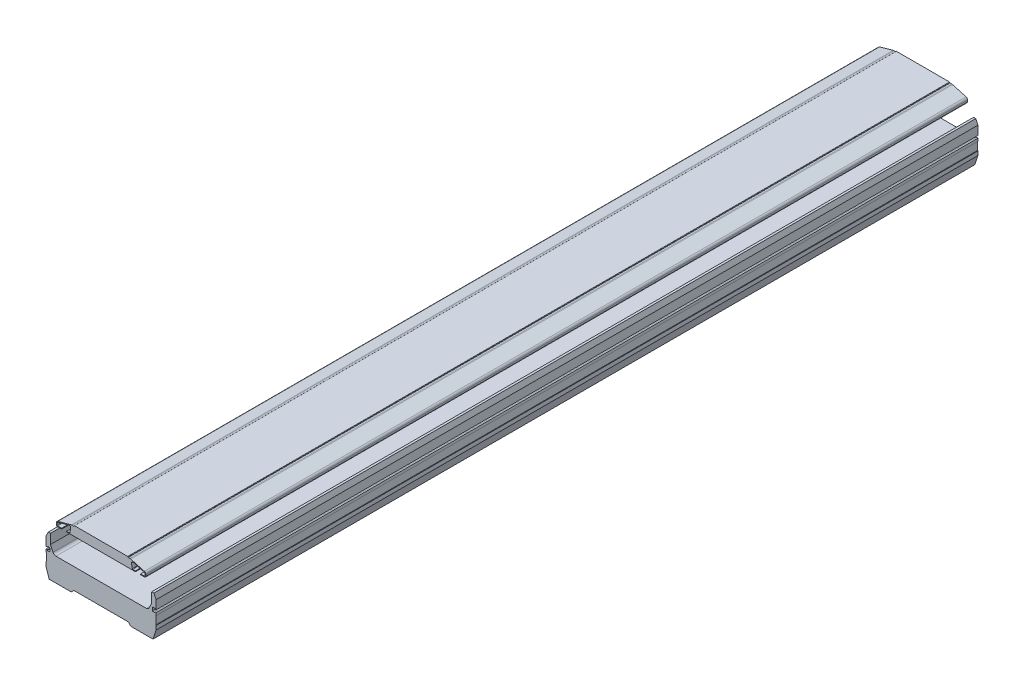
from build123d import *

# Parameters (mm, degrees)
EXTRUDE_1_DEPTH              = 1268
EXTRUDE_1_2_DEPTH            = 1268
HOLE_WIZARD_1_AT_2_COUNT     = 2
HOLE_WIZARD_1_AT_2_PITCH     = 140
HOLE_WIZARD_1_AT_3_COUNT     = 2
HOLE_WIZARD_1_AT_3_PITCH     = 205.182845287
HOLE_WIZARD_1_AT_4_COUNT     = 2
HOLE_WIZARD_1_AT_4_PITCH     = 376.961536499
HOLE_WIZARD_1_AT_5_COUNT     = 2
HOLE_WIZARD_1_AT_5_PITCH     = 567.538544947
HOLE_WIZARD_1_AT_6_COUNT     = 2
HOLE_WIZARD_1_AT_6_PITCH     = 762.954782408
HOLE_WIZARD_1_AT_7_COUNT     = 2
HOLE_WIZARD_1_AT_7_PITCH     = 960.260381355
HOLE_WIZARD_1_AT_8_COUNT     = 2
HOLE_WIZARD_1_AT_8_PITCH     = 1158.490397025
HOLE_WIZARD_1_AT_9_COUNT     = 2
HOLE_WIZARD_1_AT_9_PITCH     = 1150
HOLE_WIZARD_1_AT_10_COUNT    = 2
HOLE_WIZARD_1_AT_10_PITCH    = 950
HOLE_WIZARD_1_AT_11_COUNT    = 2
HOLE_WIZARD_1_AT_11_PITCH    = 750
HOLE_WIZARD_1_AT_12_COUNT    = 2
HOLE_WIZARD_1_AT_12_PITCH    = 550
HOLE_WIZARD_1_AT_13_COUNT    = 2
HOLE_WIZARD_1_AT_13_PITCH    = 350
HOLE_WIZARD_1_AT_14_COUNT    = 2
HOLE_WIZARD_1_AT_14_PITCH    = 150
HOLE_WIZARD_M8_1_AT_2_COUNT  = 2
HOLE_WIZARD_M8_1_AT_2_PITCH  = 140
HOLE_WIZARD_M8_1_AT_3_COUNT  = 2
HOLE_WIZARD_M8_1_AT_3_PITCH  = 205.182845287
HOLE_WIZARD_M8_1_AT_4_COUNT  = 2
HOLE_WIZARD_M8_1_AT_4_PITCH  = 376.961536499
HOLE_WIZARD_M8_1_AT_5_COUNT  = 2
HOLE_WIZARD_M8_1_AT_5_PITCH  = 567.538544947
HOLE_WIZARD_M8_1_AT_6_COUNT  = 2
HOLE_WIZARD_M8_1_AT_6_PITCH  = 762.954782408
HOLE_WIZARD_M8_1_AT_7_COUNT  = 2
HOLE_WIZARD_M8_1_AT_7_PITCH  = 960.260381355
HOLE_WIZARD_M8_1_AT_8_COUNT  = 2
HOLE_WIZARD_M8_1_AT_8_PITCH  = 1158.490397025
HOLE_WIZARD_M8_1_AT_9_COUNT  = 2
HOLE_WIZARD_M8_1_AT_9_PITCH  = 1150
HOLE_WIZARD_M8_1_AT_10_COUNT = 2
HOLE_WIZARD_M8_1_AT_10_PITCH = 950
HOLE_WIZARD_M8_1_AT_11_COUNT = 2
HOLE_WIZARD_M8_1_AT_11_PITCH = 750
HOLE_WIZARD_M8_1_AT_12_COUNT = 2
HOLE_WIZARD_M8_1_AT_12_PITCH = 550
HOLE_WIZARD_M8_1_AT_13_COUNT = 2
HOLE_WIZARD_M8_1_AT_13_PITCH = 350
HOLE_WIZARD_M8_1_AT_14_COUNT = 2
HOLE_WIZARD_M8_1_AT_14_PITCH = 150


with BuildPart() as part:
    # Sketch 1 → Extrude 1 (new body)
    with BuildSketch(Plane.XY):
        with BuildLine():
            Line((69.645372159, 32), (-69.645372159, 32))
            ThreePointArc((-69.645372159, 32), (-72.331870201, 32.783042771), (-74.176911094, 34.886908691))
            Line((-74.176911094, 34.886908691), (-78.1, 43.3))
            Line((-78.1, 43.3), (-78.1, 58.3))
            Line((-78.1, 58.3), (-81.5, 58.3))
            Line((-81.5, 58.3), (-85, 51.3))
            Line((-85, 51.3), (-85, 37.6))
            Line((-85, 37.6), (-83, 37.6))
            Line((-83, 37.6), (-83, 38.7))
            Line((-83, 38.7), (-80.2, 38.7))
            ThreePointArc((-80.2, 38.7), (-79.492893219, 38.407106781), (-79.2, 37.7))
            Line((-79.2, 37.7), (-79.2, 33.9))
            ThreePointArc((-79.2, 33.9), (-79.492893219, 33.192893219), (-80.2, 32.9))
            Line((-80.2, 32.9), (-83, 32.9))
            Line((-83, 32.9), (-83, 34))
            Line((-83, 34), (-85, 34))
            Line((-85, 34), (-85, 29.8))
            Line((-85, 29.8), (-84.5, 29.3))
            Line((-84.5, 29.3), (-84.5, 17.3))
            Line((-84.5, 17.3), (-85, 16.8))
            Line((-85, 16.8), (-85, 10.7))
            Line((-85, 10.7), (-80.1, -4))
            Line((-80.1, -4), (-46, -4))
            Line((-46, -4), (-42, 0))
            Line((-42, 0), (42, 0))
            Line((42, 0), (46, -4))
            Line((46, -4), (80.1, -4))
            Line((80.1, -4), (85, 10.7))
            Line((85, 10.7), (85, 16.8))
            Line((85, 16.8), (84.5, 17.3))
            Line((84.5, 17.3), (84.5, 29.3))
            Line((84.5, 29.3), (85, 29.8))
            Line((85, 29.8), (85, 34))
            Line((85, 34), (83, 34))
            Line((83, 34), (83, 32.9))
            Line((83, 32.9), (80.2, 32.9))
            ThreePointArc((80.2, 32.9), (79.492893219, 33.192893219), (79.2, 33.9))
            Line((79.2, 33.9), (79.2, 37.7))
            ThreePointArc((79.2, 37.7), (79.492893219, 38.407106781), (80.2, 38.7))
            Line((80.2, 38.7), (83, 38.7))
            Line((83, 38.7), (83, 37.6))
            Line((83, 37.6), (85, 37.6))
            Line((85, 37.6), (85, 51.3))
            Line((85, 51.3), (81.5, 58.3))
            Line((81.5, 58.3), (78.1, 58.3))
            Line((78.1, 58.3), (78.1, 43.3))
            Line((78.1, 43.3), (74.176911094, 34.886908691))
            ThreePointArc((74.176911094, 34.886908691), (72.331870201, 32.783042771), (69.645372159, 32))
        make_face()
    extrude(amount=EXTRUDE_1_DEPTH)

    # Sketch 3 → Hole Wizard 1 (revolve, cut)
    with BuildSketch(Plane(origin=(70, 58.3, 1194.5), x_dir=(0, 0, 1), z_dir=(1, 0, 0))):
        Polygon((0, 0), (0, 62.3), (4.5, 62.3), (4.5, 48.3), (7.5, 48.3), (7.5, 0), align=None)
    hole_wizard_1 = revolve(axis=Axis((70, 64.65, 1194.5), (0, -1, 0)), mode=Mode.SUBTRACT)

    # Hole Wizard 1 at 2: Hole Wizard 1 ×2
    with Locations(*[(-i * HOLE_WIZARD_1_AT_2_PITCH, 0, 0) for i in range(1, HOLE_WIZARD_1_AT_2_COUNT)]):
        add(hole_wizard_1, mode=Mode.SUBTRACT)

    # Hole Wizard 1 at 3: Hole Wizard 1 ×2
    with Locations(*[Vector(-0.6823182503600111, 0, -0.731055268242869) * (i * HOLE_WIZARD_1_AT_3_PITCH) for i in range(1, HOLE_WIZARD_1_AT_3_COUNT)]):
        add(hole_wizard_1, mode=Mode.SUBTRACT)

    # Hole Wizard 1 at 4: Hole Wizard 1 ×2
    with Locations(*[Vector(-0.3713906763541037, 0, -0.9284766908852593) * (i * HOLE_WIZARD_1_AT_4_PITCH) for i in range(1, HOLE_WIZARD_1_AT_4_COUNT)]):
        add(hole_wizard_1, mode=Mode.SUBTRACT)

    # Hole Wizard 1 at 5: Hole Wizard 1 ×2
    with Locations(*[Vector(-0.24667928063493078, 0, -0.9690971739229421) * (i * HOLE_WIZARD_1_AT_5_PITCH) for i in range(1, HOLE_WIZARD_1_AT_5_COUNT)]):
        add(hole_wizard_1, mode=Mode.SUBTRACT)

    # Hole Wizard 1 at 6: Hole Wizard 1 ×2
    with Locations(*[Vector(-0.18349711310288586, 0, -0.9830202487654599) * (i * HOLE_WIZARD_1_AT_6_PITCH) for i in range(1, HOLE_WIZARD_1_AT_6_COUNT)]):
        add(hole_wizard_1, mode=Mode.SUBTRACT)

    # Hole Wizard 1 at 7: Hole Wizard 1 ×2
    with Locations(*[Vector(-0.14579378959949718, 0, -0.9893150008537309) * (i * HOLE_WIZARD_1_AT_7_PITCH) for i in range(1, HOLE_WIZARD_1_AT_7_COUNT)]):
        add(hole_wizard_1, mode=Mode.SUBTRACT)

    # Hole Wizard 1 at 8: Hole Wizard 1 ×2
    with Locations(*[Vector(-0.12084692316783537, 0, -0.9926711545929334) * (i * HOLE_WIZARD_1_AT_8_PITCH) for i in range(1, HOLE_WIZARD_1_AT_8_COUNT)]):
        add(hole_wizard_1, mode=Mode.SUBTRACT)

    # Hole Wizard 1 at 9: Hole Wizard 1 ×2
    with Locations(*[(0, 0, -i * HOLE_WIZARD_1_AT_9_PITCH) for i in range(1, HOLE_WIZARD_1_AT_9_COUNT)]):
        add(hole_wizard_1, mode=Mode.SUBTRACT)

    # Hole Wizard 1 at 10: Hole Wizard 1 ×2
    with Locations(*[(0, 0, -i * HOLE_WIZARD_1_AT_10_PITCH) for i in range(1, HOLE_WIZARD_1_AT_10_COUNT)]):
        add(hole_wizard_1, mode=Mode.SUBTRACT)

    # Hole Wizard 1 at 11: Hole Wizard 1 ×2
    with Locations(*[(0, 0, -i * HOLE_WIZARD_1_AT_11_PITCH) for i in range(1, HOLE_WIZARD_1_AT_11_COUNT)]):
        add(hole_wizard_1, mode=Mode.SUBTRACT)

    # Hole Wizard 1 at 12: Hole Wizard 1 ×2
    with Locations(*[(0, 0, -i * HOLE_WIZARD_1_AT_12_PITCH) for i in range(1, HOLE_WIZARD_1_AT_12_COUNT)]):
        add(hole_wizard_1, mode=Mode.SUBTRACT)

    # Hole Wizard 1 at 13: Hole Wizard 1 ×2
    with Locations(*[(0, 0, -i * HOLE_WIZARD_1_AT_13_PITCH) for i in range(1, HOLE_WIZARD_1_AT_13_COUNT)]):
        add(hole_wizard_1, mode=Mode.SUBTRACT)

    # Hole Wizard 1 at 14: Hole Wizard 1 ×2
    with Locations(*[(0, 0, -i * HOLE_WIZARD_1_AT_14_PITCH) for i in range(1, HOLE_WIZARD_1_AT_14_COUNT)]):
        add(hole_wizard_1, mode=Mode.SUBTRACT)

    # Sketch 5 → Hole Wizard M8 _1 (revolve, cut)
    with BuildSketch(Plane(origin=(-70, -4, 1209.5), x_dir=(0, 0, -1), z_dir=(1, 0, 0))):
        Polygon((0, 0), (0, 17.792926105), (3.4, 15.75), (3.4, 0), align=None)
    hole_wizard_m8_1 = revolve(axis=Axis((-70, -10.35, 1209.5), (0, 1, 0)), mode=Mode.SUBTRACT)

    # Hole Wizard M8 _1 at 2: Hole Wizard M8 _1 ×2
    with Locations(*[(i * HOLE_WIZARD_M8_1_AT_2_PITCH, 0, 0) for i in range(1, HOLE_WIZARD_M8_1_AT_2_COUNT)]):
        add(hole_wizard_m8_1, mode=Mode.SUBTRACT)

    # Hole Wizard M8 _1 at 3: Hole Wizard M8 _1 ×2
    with Locations(*[Vector(0.6823182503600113, -2.7487351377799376e-14, -0.731055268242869) * (i * HOLE_WIZARD_M8_1_AT_3_PITCH) for i in range(1, HOLE_WIZARD_M8_1_AT_3_COUNT)]):
        add(hole_wizard_m8_1, mode=Mode.SUBTRACT)

    # Hole Wizard M8 _1 at 4: Hole Wizard M8 _1 ×2
    with Locations(*[Vector(0.37139067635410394, -1.496156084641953e-14, -0.9284766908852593) * (i * HOLE_WIZARD_M8_1_AT_4_PITCH) for i in range(1, HOLE_WIZARD_M8_1_AT_4_COUNT)]):
        add(hole_wizard_m8_1, mode=Mode.SUBTRACT)

    # Hole Wizard M8 _1 at 5: Hole Wizard M8 _1 ×2
    with Locations(*[Vector(0.2466792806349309, -9.937532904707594e-15, -0.9690971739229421) * (i * HOLE_WIZARD_M8_1_AT_5_PITCH) for i in range(1, HOLE_WIZARD_M8_1_AT_5_COUNT)]):
        add(hole_wizard_m8_1, mode=Mode.SUBTRACT)

    # Hole Wizard M8 _1 at 6: Hole Wizard M8 _1 ×2
    with Locations(*[Vector(0.18349711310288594, -7.392224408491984e-15, -0.9830202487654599) * (i * HOLE_WIZARD_M8_1_AT_6_PITCH) for i in range(1, HOLE_WIZARD_M8_1_AT_6_COUNT)]):
        add(hole_wizard_m8_1, mode=Mode.SUBTRACT)

    # Hole Wizard M8 _1 at 7: Hole Wizard M8 _1 ×2
    with Locations(*[Vector(0.14579378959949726, -5.873337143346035e-15, -0.9893150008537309) * (i * HOLE_WIZARD_M8_1_AT_7_PITCH) for i in range(1, HOLE_WIZARD_M8_1_AT_7_COUNT)]):
        add(hole_wizard_m8_1, mode=Mode.SUBTRACT)

    # Hole Wizard M8 _1 at 8: Hole Wizard M8 _1 ×2
    with Locations(*[Vector(0.12084692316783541, -4.868346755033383e-15, -0.9926711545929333) * (i * HOLE_WIZARD_M8_1_AT_8_PITCH) for i in range(1, HOLE_WIZARD_M8_1_AT_8_COUNT)]):
        add(hole_wizard_m8_1, mode=Mode.SUBTRACT)

    # Hole Wizard M8 _1 at 9: Hole Wizard M8 _1 ×2
    with Locations(*[(0, 0, -i * HOLE_WIZARD_M8_1_AT_9_PITCH) for i in range(1, HOLE_WIZARD_M8_1_AT_9_COUNT)]):
        add(hole_wizard_m8_1, mode=Mode.SUBTRACT)

    # Hole Wizard M8 _1 at 10: Hole Wizard M8 _1 ×2
    with Locations(*[(0, 0, -i * HOLE_WIZARD_M8_1_AT_10_PITCH) for i in range(1, HOLE_WIZARD_M8_1_AT_10_COUNT)]):
        add(hole_wizard_m8_1, mode=Mode.SUBTRACT)

    # Hole Wizard M8 _1 at 11: Hole Wizard M8 _1 ×2
    with Locations(*[(0, 0, -i * HOLE_WIZARD_M8_1_AT_11_PITCH) for i in range(1, HOLE_WIZARD_M8_1_AT_11_COUNT)]):
        add(hole_wizard_m8_1, mode=Mode.SUBTRACT)

    # Hole Wizard M8 _1 at 12: Hole Wizard M8 _1 ×2
    with Locations(*[(0, 0, -i * HOLE_WIZARD_M8_1_AT_12_PITCH) for i in range(1, HOLE_WIZARD_M8_1_AT_12_COUNT)]):
        add(hole_wizard_m8_1, mode=Mode.SUBTRACT)

    # Hole Wizard M8 _1 at 13: Hole Wizard M8 _1 ×2
    with Locations(*[(0, 0, -i * HOLE_WIZARD_M8_1_AT_13_PITCH) for i in range(1, HOLE_WIZARD_M8_1_AT_13_COUNT)]):
        add(hole_wizard_m8_1, mode=Mode.SUBTRACT)

    # Hole Wizard M8 _1 at 14: Hole Wizard M8 _1 ×2
    with Locations(*[(0, 0, -i * HOLE_WIZARD_M8_1_AT_14_PITCH) for i in range(1, HOLE_WIZARD_M8_1_AT_14_COUNT)]):
        add(hole_wizard_m8_1, mode=Mode.SUBTRACT)


with BuildPart() as body_2:
    # Sketch 1 → Extrude 1 2 (new body)
    with BuildSketch(Plane.XY):
        with BuildLine():
            Line((41, 87), (-41, 87))
            ThreePointArc((-41, 87), (-41.353553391, 86.853553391), (-41.5, 86.5))
            ThreePointArc((-41.5, 86.5), (-41.646446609, 86.146446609), (-42, 86))
            Line((-42, 86), (-44.425413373, 86))
            ThreePointArc((-44.425413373, 86), (-45.099668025, 85.954329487), (-45.761605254, 85.818152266))
            Line((-45.761605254, 85.818152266), (-66.655162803, 80.023855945))
            ThreePointArc((-66.655162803, 80.023855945), (-68.347206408, 78.877179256), (-69, 76.940238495))
            Line((-69, 76.940238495), (-69, 74.5))
            ThreePointArc((-69, 74.5), (-68.414213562, 73.085786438), (-67, 72.5))
            Line((-67, 72.5), (-61, 72.5))
            Line((-61, 72.5), (-61, 73.7))
            Line((-61, 73.7), (-67, 73.7))
            ThreePointArc((-67, 73.7), (-67.565685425, 73.934314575), (-67.8, 74.5))
            Line((-67.8, 74.5), (-67.8, 76.940238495))
            ThreePointArc((-67.8, 76.940238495), (-67.392004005, 78.150826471), (-66.334476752, 78.867499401))
            Line((-66.334476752, 78.867499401), (-49.610647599, 83.505427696))
            ThreePointArc((-49.610647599, 83.505427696), (-47.555281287, 83.011977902), (-46.884572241, 81.007439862))
            Line((-46.884572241, 81.007439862), (-48.117675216, 74.35421158))
            ThreePointArc((-48.117675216, 74.35421158), (-48.392727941, 73.884926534), (-48.904279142, 73.7))
            Line((-48.904279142, 73.7), (-53, 73.7))
            Line((-53, 73.7), (-53, 72.5))
            Line((-53, 72.5), (53, 72.5))
            Line((53, 72.5), (53, 73.7))
            Line((53, 73.7), (48.904279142, 73.7))
            ThreePointArc((48.904279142, 73.7), (48.392727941, 73.884926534), (48.117675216, 74.35421158))
            Line((48.117675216, 74.35421158), (46.884572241, 81.007439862))
            ThreePointArc((46.884572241, 81.007439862), (47.555281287, 83.011977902), (49.610647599, 83.505427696))
            Line((49.610647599, 83.505427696), (66.334476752, 78.867499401))
            ThreePointArc((66.334476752, 78.867499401), (67.392004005, 78.150826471), (67.8, 76.940238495))
            Line((67.8, 76.940238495), (67.8, 74.5))
            ThreePointArc((67.8, 74.5), (67.565685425, 73.934314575), (67, 73.7))
            Line((67, 73.7), (61, 73.7))
            Line((61, 73.7), (61, 72.5))
            Line((61, 72.5), (67, 72.5))
            ThreePointArc((67, 72.5), (68.414213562, 73.085786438), (69, 74.5))
            Line((69, 74.5), (69, 76.940238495))
            ThreePointArc((69, 76.940238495), (68.347206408, 78.877179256), (66.655162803, 80.023855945))
            Line((66.655162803, 80.023855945), (45.761605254, 85.818152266))
            ThreePointArc((45.761605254, 85.818152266), (45.099668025, 85.954329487), (44.425413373, 86))
            Line((44.425413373, 86), (42, 86))
            ThreePointArc((42, 86), (41.646446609, 86.146446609), (41.5, 86.5))
            ThreePointArc((41.5, 86.5), (41.353553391, 86.853553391), (41, 87))
        make_face()
    extrude(amount=EXTRUDE_1_2_DEPTH)


solid = Compound([part.part, body_2.part])
